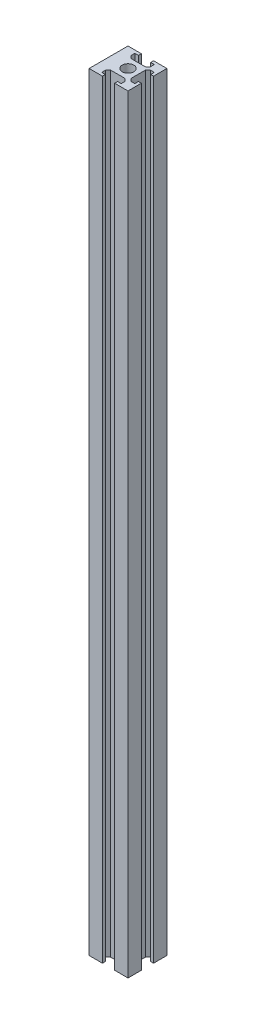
ISO-10303-21;
HEADER;
FILE_DESCRIPTION(('STEP AP214'),'2;1');
FILE_NAME('part.step','',(''),(''),'','','');
FILE_SCHEMA(('AUTOMOTIVE_DESIGN { 1 0 10303 214 1 1 1 1 }'));
ENDSEC;
DATA;
#1=APPLICATION_CONTEXT('core data for automotive mechanical design processes');
#2=APPLICATION_PROTOCOL_DEFINITION('international standard','automotive_design',2000,#1);
#3=PRODUCT_CONTEXT('',#1,'mechanical');
#4=PRODUCT('Part','Part','',(#3));
#5=PRODUCT_RELATED_PRODUCT_CATEGORY('part','',(#4));
#6=PRODUCT_DEFINITION_FORMATION('','',#4);
#7=PRODUCT_DEFINITION_CONTEXT('part definition',#1,'design');
#8=PRODUCT_DEFINITION('design','',#6,#7);
#9=PRODUCT_DEFINITION_SHAPE('','',#8);
#10=(LENGTH_UNIT() NAMED_UNIT(*) SI_UNIT(.MILLI.,.METRE.));
#11=(NAMED_UNIT(*) PLANE_ANGLE_UNIT() SI_UNIT($,.RADIAN.));
#12=(NAMED_UNIT(*) SI_UNIT($,.STERADIAN.) SOLID_ANGLE_UNIT());
#13=UNCERTAINTY_MEASURE_WITH_UNIT(LENGTH_MEASURE(1.E-05),#10,'distance_accuracy_value','');
#14=(GEOMETRIC_REPRESENTATION_CONTEXT(3) GLOBAL_UNCERTAINTY_ASSIGNED_CONTEXT((#13)) GLOBAL_UNIT_ASSIGNED_CONTEXT((#10,
#11,#12)) REPRESENTATION_CONTEXT('',''));
#15=CARTESIAN_POINT('',(0.,0.,0.));
#16=DIRECTION('',(0.,0.,1.));
#17=DIRECTION('',(1.,0.,0.));
#18=AXIS2_PLACEMENT_3D('',#15,#16,#17);
#19=CARTESIAN_POINT('',(0.,395.,0.));
#20=DIRECTION('',(0.,1.,0.));
#21=DIRECTION('',(0.,0.,1.));
#22=AXIS2_PLACEMENT_3D('',#19,#20,#21);
#23=PLANE('',#22);
#24=DIRECTION('',(0.,0.,1.));
#25=VECTOR('',#24,1.);
#26=CARTESIAN_POINT('',(-10.,395.,-10.));
#27=LINE('',#26,#25);
#28=CARTESIAN_POINT('',(-10.,395.,-10.));
#29=VERTEX_POINT('',#28);
#30=CARTESIAN_POINT('',(-10.,395.,10.));
#31=VERTEX_POINT('',#30);
#32=EDGE_CURVE('E353',#29,#31,#27,.T.);
#33=ORIENTED_EDGE('',*,*,#32,.T.);
#34=DIRECTION('',(1.,0.,0.));
#35=VECTOR('',#34,1.);
#36=CARTESIAN_POINT('',(-10.,395.,10.));
#37=LINE('',#36,#35);
#38=CARTESIAN_POINT('',(-3.125,395.,10.));
#39=VERTEX_POINT('',#38);
#40=EDGE_CURVE('E171',#31,#39,#37,.T.);
#41=ORIENTED_EDGE('',*,*,#40,.T.);
#42=DIRECTION('',(0.,0.,-1.));
#43=VECTOR('',#42,1.);
#44=CARTESIAN_POINT('',(-3.125,395.,10.));
#45=LINE('',#44,#43);
#46=CARTESIAN_POINT('',(-3.125,395.,8.5));
#47=VERTEX_POINT('',#46);
#48=EDGE_CURVE('E446',#39,#47,#45,.T.);
#49=ORIENTED_EDGE('',*,*,#48,.T.);
#50=DIRECTION('',(-1.,0.,0.));
#51=VECTOR('',#50,1.);
#52=CARTESIAN_POINT('',(-3.125,395.,8.5));
#53=LINE('',#52,#51);
#54=CARTESIAN_POINT('',(-5.,395.,8.5));
#55=VERTEX_POINT('',#54);
#56=EDGE_CURVE('E465',#47,#55,#53,.T.);
#57=ORIENTED_EDGE('',*,*,#56,.T.);
#58=DIRECTION('',(0.,0.,-1.));
#59=VECTOR('',#58,1.);
#60=CARTESIAN_POINT('',(-5.,395.,8.5));
#61=LINE('',#60,#59);
#62=CARTESIAN_POINT('',(-5.00000000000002,395.,6.50482755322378));
#63=VERTEX_POINT('',#62);
#64=EDGE_CURVE('E462',#55,#63,#61,.T.);
#65=ORIENTED_EDGE('',*,*,#64,.T.);
#66=DIRECTION('',(0.703833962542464,0.,-0.71036452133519));
#67=VECTOR('',#66,1.);
#68=CARTESIAN_POINT('',(-5.00000000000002,395.,6.50482755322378));
#69=LINE('',#68,#67);
#70=CARTESIAN_POINT('',(-3.7071680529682,395.,5.19999999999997));
#71=VERTEX_POINT('',#70);
#72=EDGE_CURVE('E464',#63,#71,#69,.T.);
#73=ORIENTED_EDGE('',*,*,#72,.T.);
#74=DIRECTION('',(1.,0.,0.));
#75=VECTOR('',#74,1.);
#76=CARTESIAN_POINT('',(3.7071680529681,395.,5.20000000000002));
#77=LINE('',#76,#75);
#78=CARTESIAN_POINT('',(3.7071680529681,395.,5.20000000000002));
#79=VERTEX_POINT('',#78);
#80=EDGE_CURVE('E467',#71,#79,#77,.T.);
#81=ORIENTED_EDGE('',*,*,#80,.T.);
#82=DIRECTION('',(0.703833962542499,0.,0.710364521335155));
#83=VECTOR('',#82,1.);
#84=CARTESIAN_POINT('',(5.,395.,6.50482755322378));
#85=LINE('',#84,#83);
#86=CARTESIAN_POINT('',(5.,395.,6.50482755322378));
#87=VERTEX_POINT('',#86);
#88=EDGE_CURVE('E473',#79,#87,#85,.T.);
#89=ORIENTED_EDGE('',*,*,#88,.T.);
#90=DIRECTION('',(0.,0.,1.));
#91=VECTOR('',#90,1.);
#92=CARTESIAN_POINT('',(5.,395.,8.5));
#93=LINE('',#92,#91);
#94=CARTESIAN_POINT('',(5.,395.,8.5));
#95=VERTEX_POINT('',#94);
#96=EDGE_CURVE('E475',#87,#95,#93,.T.);
#97=ORIENTED_EDGE('',*,*,#96,.T.);
#98=DIRECTION('',(-1.,0.,0.));
#99=VECTOR('',#98,1.);
#100=CARTESIAN_POINT('',(3.125,395.,8.5));
#101=LINE('',#100,#99);
#102=CARTESIAN_POINT('',(3.125,395.,8.5));
#103=VERTEX_POINT('',#102);
#104=EDGE_CURVE('E477',#95,#103,#101,.T.);
#105=ORIENTED_EDGE('',*,*,#104,.T.);
#106=DIRECTION('',(0.,0.,1.));
#107=VECTOR('',#106,1.);
#108=CARTESIAN_POINT('',(3.125,395.,10.));
#109=LINE('',#108,#107);
#110=CARTESIAN_POINT('',(3.125,395.,10.));
#111=VERTEX_POINT('',#110);
#112=EDGE_CURVE('E479',#103,#111,#109,.T.);
#113=ORIENTED_EDGE('',*,*,#112,.T.);
#114=DIRECTION('',(1.,0.,0.));
#115=VECTOR('',#114,1.);
#116=CARTESIAN_POINT('',(3.125,395.,10.));
#117=LINE('',#116,#115);
#118=CARTESIAN_POINT('',(10.,395.,10.));
#119=VERTEX_POINT('',#118);
#120=EDGE_CURVE('E481',#111,#119,#117,.T.);
#121=ORIENTED_EDGE('',*,*,#120,.T.);
#122=DIRECTION('',(0.,0.,-1.));
#123=VECTOR('',#122,1.);
#124=CARTESIAN_POINT('',(9.99999999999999,395.,3.12500000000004));
#125=LINE('',#124,#123);
#126=CARTESIAN_POINT('',(9.99999999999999,395.,3.12500000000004));
#127=VERTEX_POINT('',#126);
#128=EDGE_CURVE('E483',#119,#127,#125,.T.);
#129=ORIENTED_EDGE('',*,*,#128,.T.);
#130=DIRECTION('',(-1.,0.,0.));
#131=VECTOR('',#130,1.);
#132=CARTESIAN_POINT('',(9.99999999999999,395.,3.12500000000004));
#133=LINE('',#132,#131);
#134=CARTESIAN_POINT('',(8.49999999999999,395.,3.12500000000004));
#135=VERTEX_POINT('',#134);
#136=EDGE_CURVE('E485',#127,#135,#133,.T.);
#137=ORIENTED_EDGE('',*,*,#136,.T.);
#138=DIRECTION('',(0.,0.,1.));
#139=VECTOR('',#138,1.);
#140=CARTESIAN_POINT('',(8.49999999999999,395.,3.12500000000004));
#141=LINE('',#140,#139);
#142=CARTESIAN_POINT('',(8.49999999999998,395.,5.00000000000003));
#143=VERTEX_POINT('',#142);
#144=EDGE_CURVE('E487',#135,#143,#141,.T.);
#145=ORIENTED_EDGE('',*,*,#144,.T.);
#146=DIRECTION('',(-1.,0.,0.));
#147=VECTOR('',#146,1.);
#148=CARTESIAN_POINT('',(8.49999999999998,395.,5.00000000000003));
#149=LINE('',#148,#147);
#150=CARTESIAN_POINT('',(6.50482755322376,395.,5.00000000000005));
#151=VERTEX_POINT('',#150);
#152=EDGE_CURVE('E489',#143,#151,#149,.T.);
#153=ORIENTED_EDGE('',*,*,#152,.T.);
#154=DIRECTION('',(-0.71036452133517,0.,-0.703833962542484));
#155=VECTOR('',#154,1.);
#156=CARTESIAN_POINT('',(6.50482755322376,395.,5.00000000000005));
#157=LINE('',#156,#155);
#158=CARTESIAN_POINT('',(5.19999999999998,395.,3.70716805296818));
#159=VERTEX_POINT('',#158);
#160=EDGE_CURVE('E491',#151,#159,#157,.T.);
#161=ORIENTED_EDGE('',*,*,#160,.T.);
#162=DIRECTION('',(0.,0.,-1.));
#163=VECTOR('',#162,1.);
#164=CARTESIAN_POINT('',(5.20000000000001,395.,-3.70716805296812));
#165=LINE('',#164,#163);
#166=CARTESIAN_POINT('',(5.20000000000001,395.,-3.70716805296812));
#167=VERTEX_POINT('',#166);
#168=EDGE_CURVE('E493',#159,#167,#165,.T.);
#169=ORIENTED_EDGE('',*,*,#168,.T.);
#170=DIRECTION('',(0.710364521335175,0.,-0.703833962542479));
#171=VECTOR('',#170,1.);
#172=CARTESIAN_POINT('',(6.5048275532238,395.,-4.99999999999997));
#173=LINE('',#172,#171);
#174=CARTESIAN_POINT('',(6.5048275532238,395.,-4.99999999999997));
#175=VERTEX_POINT('',#174);
#176=EDGE_CURVE('E495',#167,#175,#173,.T.);
#177=ORIENTED_EDGE('',*,*,#176,.T.);
#178=DIRECTION('',(1.,0.,0.));
#179=VECTOR('',#178,1.);
#180=CARTESIAN_POINT('',(8.50000000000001,395.,-4.99999999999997));
#181=LINE('',#180,#179);
#182=CARTESIAN_POINT('',(8.50000000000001,395.,-4.99999999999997));
#183=VERTEX_POINT('',#182);
#184=EDGE_CURVE('E497',#175,#183,#181,.T.);
#185=ORIENTED_EDGE('',*,*,#184,.T.);
#186=DIRECTION('',(0.,0.,1.));
#187=VECTOR('',#186,1.);
#188=CARTESIAN_POINT('',(8.50000000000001,395.,-3.12499999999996));
#189=LINE('',#188,#187);
#190=CARTESIAN_POINT('',(8.50000000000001,395.,-3.12499999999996));
#191=VERTEX_POINT('',#190);
#192=EDGE_CURVE('E499',#183,#191,#189,.T.);
#193=ORIENTED_EDGE('',*,*,#192,.T.);
#194=DIRECTION('',(1.,0.,0.));
#195=VECTOR('',#194,1.);
#196=CARTESIAN_POINT('',(10.,395.,-3.12499999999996));
#197=LINE('',#196,#195);
#198=CARTESIAN_POINT('',(10.,395.,-3.12499999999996));
#199=VERTEX_POINT('',#198);
#200=EDGE_CURVE('E501',#191,#199,#197,.T.);
#201=ORIENTED_EDGE('',*,*,#200,.T.);
#202=DIRECTION('',(0.,0.,-1.));
#203=VECTOR('',#202,1.);
#204=CARTESIAN_POINT('',(10.,395.,-10.));
#205=LINE('',#204,#203);
#206=CARTESIAN_POINT('',(10.,395.,-10.));
#207=VERTEX_POINT('',#206);
#208=EDGE_CURVE('E503',#199,#207,#205,.T.);
#209=ORIENTED_EDGE('',*,*,#208,.T.);
#210=DIRECTION('',(-1.,0.,0.));
#211=VECTOR('',#210,1.);
#212=CARTESIAN_POINT('',(3.125,395.,-10.));
#213=LINE('',#212,#211);
#214=CARTESIAN_POINT('',(3.125,395.,-10.));
#215=VERTEX_POINT('',#214);
#216=EDGE_CURVE('E505',#207,#215,#213,.T.);
#217=ORIENTED_EDGE('',*,*,#216,.T.);
#218=DIRECTION('',(0.,0.,1.));
#219=VECTOR('',#218,1.);
#220=CARTESIAN_POINT('',(3.125,395.,-10.));
#221=LINE('',#220,#219);
#222=CARTESIAN_POINT('',(3.12500000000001,395.,-8.5));
#223=VERTEX_POINT('',#222);
#224=EDGE_CURVE('E507',#215,#223,#221,.T.);
#225=ORIENTED_EDGE('',*,*,#224,.T.);
#226=DIRECTION('',(1.,0.,0.));
#227=VECTOR('',#226,1.);
#228=CARTESIAN_POINT('',(3.12500000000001,395.,-8.5));
#229=LINE('',#228,#227);
#230=CARTESIAN_POINT('',(5.00000000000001,395.,-8.5));
#231=VERTEX_POINT('',#230);
#232=EDGE_CURVE('E509',#223,#231,#229,.T.);
#233=ORIENTED_EDGE('',*,*,#232,.T.);
#234=DIRECTION('',(0.,0.,1.));
#235=VECTOR('',#234,1.);
#236=CARTESIAN_POINT('',(5.00000000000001,395.,-8.5));
#237=LINE('',#236,#235);
#238=CARTESIAN_POINT('',(5.00000000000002,395.,-6.50482755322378));
#239=VERTEX_POINT('',#238);
#240=EDGE_CURVE('E511',#231,#239,#237,.T.);
#241=ORIENTED_EDGE('',*,*,#240,.T.);
#242=DIRECTION('',(-0.703833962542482,0.,0.710364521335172));
#243=VECTOR('',#242,1.);
#244=CARTESIAN_POINT('',(5.00000000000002,395.,-6.50482755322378));
#245=LINE('',#244,#243);
#246=CARTESIAN_POINT('',(3.70716805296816,395.,-5.2));
#247=VERTEX_POINT('',#246);
#248=EDGE_CURVE('E513',#239,#247,#245,.T.);
#249=ORIENTED_EDGE('',*,*,#248,.T.);
#250=DIRECTION('',(-1.,0.,0.));
#251=VECTOR('',#250,1.);
#252=CARTESIAN_POINT('',(-3.70716805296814,395.,-5.2));
#253=LINE('',#252,#251);
#254=CARTESIAN_POINT('',(-3.70716805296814,395.,-5.2));
#255=VERTEX_POINT('',#254);
#256=EDGE_CURVE('E515',#247,#255,#253,.T.);
#257=ORIENTED_EDGE('',*,*,#256,.T.);
#258=DIRECTION('',(-0.703833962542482,0.,-0.710364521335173));
#259=VECTOR('',#258,1.);
#260=CARTESIAN_POINT('',(-4.99999999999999,395.,-6.50482755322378));
#261=LINE('',#260,#259);
#262=CARTESIAN_POINT('',(-4.99999999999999,395.,-6.50482755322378));
#263=VERTEX_POINT('',#262);
#264=EDGE_CURVE('E517',#255,#263,#261,.T.);
#265=ORIENTED_EDGE('',*,*,#264,.T.);
#266=DIRECTION('',(0.,0.,-1.));
#267=VECTOR('',#266,1.);
#268=CARTESIAN_POINT('',(-4.99999999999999,395.,-8.5));
#269=LINE('',#268,#267);
#270=CARTESIAN_POINT('',(-4.99999999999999,395.,-8.5));
#271=VERTEX_POINT('',#270);
#272=EDGE_CURVE('E268',#263,#271,#269,.T.);
#273=ORIENTED_EDGE('',*,*,#272,.T.);
#274=DIRECTION('',(1.,0.,0.));
#275=VECTOR('',#274,1.);
#276=CARTESIAN_POINT('',(-3.12499999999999,395.,-8.5));
#277=LINE('',#276,#275);
#278=CARTESIAN_POINT('',(-3.12499999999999,395.,-8.5));
#279=VERTEX_POINT('',#278);
#280=EDGE_CURVE('E262',#271,#279,#277,.T.);
#281=ORIENTED_EDGE('',*,*,#280,.T.);
#282=DIRECTION('',(0.,0.,-1.));
#283=VECTOR('',#282,1.);
#284=CARTESIAN_POINT('',(-3.12499999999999,395.,-10.));
#285=LINE('',#284,#283);
#286=CARTESIAN_POINT('',(-3.12499999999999,395.,-10.));
#287=VERTEX_POINT('',#286);
#288=EDGE_CURVE('E266',#279,#287,#285,.T.);
#289=ORIENTED_EDGE('',*,*,#288,.T.);
#290=DIRECTION('',(-1.,0.,0.));
#291=VECTOR('',#290,1.);
#292=CARTESIAN_POINT('',(-10.,395.,-10.));
#293=LINE('',#292,#291);
#294=EDGE_CURVE('E50',#287,#29,#293,.T.);
#295=ORIENTED_EDGE('',*,*,#294,.T.);
#296=EDGE_LOOP('',(#33,#41,#49,#57,#65,#73,#81,#89,#97,#105,#113,#121,#129,#137,#145,#153,#161,
#169,#177,#185,#193,#201,#209,#217,#225,#233,#241,#249,#257,#265,#273,#281,#289,#295));
#297=FACE_BOUND('',#296,.T.);
#298=CARTESIAN_POINT('',(0.,395.,0.));
#299=DIRECTION('',(0.,1.,0.));
#300=DIRECTION('',(0.,0.,1.));
#301=AXIS2_PLACEMENT_3D('',#298,#299,#300);
#302=CIRCLE('',#301,3.);
#303=CARTESIAN_POINT('',(0.,395.,-3.00000000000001));
#304=VERTEX_POINT('',#303);
#305=EDGE_CURVE('E290',#304,#304,#302,.T.);
#306=ORIENTED_EDGE('',*,*,#305,.F.);
#307=EDGE_LOOP('',(#306));
#308=FACE_BOUND('',#307,.T.);
#309=ADVANCED_FACE('F33',(#297,#308),#23,.T.);
#310=CARTESIAN_POINT('',(0.,0.,0.));
#311=DIRECTION('',(0.,1.,0.));
#312=DIRECTION('',(0.,0.,1.));
#313=AXIS2_PLACEMENT_3D('',#310,#311,#312);
#314=PLANE('',#313);
#315=DIRECTION('',(0.,0.,1.));
#316=VECTOR('',#315,1.);
#317=CARTESIAN_POINT('',(-10.,0.,-10.));
#318=LINE('',#317,#316);
#319=CARTESIAN_POINT('',(-10.,0.,-10.));
#320=VERTEX_POINT('',#319);
#321=CARTESIAN_POINT('',(-10.,0.,10.));
#322=VERTEX_POINT('',#321);
#323=EDGE_CURVE('E286',#320,#322,#318,.T.);
#324=ORIENTED_EDGE('',*,*,#323,.F.);
#325=DIRECTION('',(-1.,0.,0.));
#326=VECTOR('',#325,1.);
#327=CARTESIAN_POINT('',(-10.,0.,-10.));
#328=LINE('',#327,#326);
#329=CARTESIAN_POINT('',(-3.12499999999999,0.,-10.));
#330=VERTEX_POINT('',#329);
#331=EDGE_CURVE('E163',#330,#320,#328,.T.);
#332=ORIENTED_EDGE('',*,*,#331,.F.);
#333=DIRECTION('',(0.,0.,-1.));
#334=VECTOR('',#333,1.);
#335=CARTESIAN_POINT('',(-3.12499999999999,0.,-10.));
#336=LINE('',#335,#334);
#337=CARTESIAN_POINT('',(-3.12499999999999,0.,-8.5));
#338=VERTEX_POINT('',#337);
#339=EDGE_CURVE('E157',#338,#330,#336,.T.);
#340=ORIENTED_EDGE('',*,*,#339,.F.);
#341=DIRECTION('',(1.,0.,0.));
#342=VECTOR('',#341,1.);
#343=CARTESIAN_POINT('',(-3.12499999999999,0.,-8.5));
#344=LINE('',#343,#342);
#345=CARTESIAN_POINT('',(-4.99999999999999,0.,-8.5));
#346=VERTEX_POINT('',#345);
#347=EDGE_CURVE('E276',#346,#338,#344,.T.);
#348=ORIENTED_EDGE('',*,*,#347,.F.);
#349=DIRECTION('',(0.,0.,-1.));
#350=VECTOR('',#349,1.);
#351=CARTESIAN_POINT('',(-4.99999999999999,0.,-8.5));
#352=LINE('',#351,#350);
#353=CARTESIAN_POINT('',(-4.99999999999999,0.,-6.50482755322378));
#354=VERTEX_POINT('',#353);
#355=EDGE_CURVE('E348',#354,#346,#352,.T.);
#356=ORIENTED_EDGE('',*,*,#355,.F.);
#357=DIRECTION('',(-0.703833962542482,0.,-0.710364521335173));
#358=VECTOR('',#357,1.);
#359=CARTESIAN_POINT('',(-4.99999999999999,0.,-6.50482755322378));
#360=LINE('',#359,#358);
#361=CARTESIAN_POINT('',(-3.70716805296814,0.,-5.2));
#362=VERTEX_POINT('',#361);
#363=EDGE_CURVE('E346',#362,#354,#360,.T.);
#364=ORIENTED_EDGE('',*,*,#363,.F.);
#365=DIRECTION('',(-1.,0.,0.));
#366=VECTOR('',#365,1.);
#367=CARTESIAN_POINT('',(-3.70716805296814,0.,-5.2));
#368=LINE('',#367,#366);
#369=CARTESIAN_POINT('',(3.70716805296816,0.,-5.2));
#370=VERTEX_POINT('',#369);
#371=EDGE_CURVE('E344',#370,#362,#368,.T.);
#372=ORIENTED_EDGE('',*,*,#371,.F.);
#373=DIRECTION('',(-0.703833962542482,0.,0.710364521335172));
#374=VECTOR('',#373,1.);
#375=CARTESIAN_POINT('',(5.00000000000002,0.,-6.50482755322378));
#376=LINE('',#375,#374);
#377=CARTESIAN_POINT('',(5.00000000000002,0.,-6.50482755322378));
#378=VERTEX_POINT('',#377);
#379=EDGE_CURVE('E342',#378,#370,#376,.T.);
#380=ORIENTED_EDGE('',*,*,#379,.F.);
#381=DIRECTION('',(0.,0.,1.));
#382=VECTOR('',#381,1.);
#383=CARTESIAN_POINT('',(5.00000000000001,0.,-8.5));
#384=LINE('',#383,#382);
#385=CARTESIAN_POINT('',(5.00000000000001,0.,-8.5));
#386=VERTEX_POINT('',#385);
#387=EDGE_CURVE('E340',#386,#378,#384,.T.);
#388=ORIENTED_EDGE('',*,*,#387,.F.);
#389=DIRECTION('',(1.,0.,0.));
#390=VECTOR('',#389,1.);
#391=CARTESIAN_POINT('',(3.12500000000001,0.,-8.5));
#392=LINE('',#391,#390);
#393=CARTESIAN_POINT('',(3.12500000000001,0.,-8.5));
#394=VERTEX_POINT('',#393);
#395=EDGE_CURVE('E338',#394,#386,#392,.T.);
#396=ORIENTED_EDGE('',*,*,#395,.F.);
#397=DIRECTION('',(0.,0.,1.));
#398=VECTOR('',#397,1.);
#399=CARTESIAN_POINT('',(3.125,0.,-10.));
#400=LINE('',#399,#398);
#401=CARTESIAN_POINT('',(3.125,0.,-10.));
#402=VERTEX_POINT('',#401);
#403=EDGE_CURVE('E336',#402,#394,#400,.T.);
#404=ORIENTED_EDGE('',*,*,#403,.F.);
#405=DIRECTION('',(-1.,0.,0.));
#406=VECTOR('',#405,1.);
#407=CARTESIAN_POINT('',(3.125,0.,-10.));
#408=LINE('',#407,#406);
#409=CARTESIAN_POINT('',(10.,0.,-10.));
#410=VERTEX_POINT('',#409);
#411=EDGE_CURVE('E334',#410,#402,#408,.T.);
#412=ORIENTED_EDGE('',*,*,#411,.F.);
#413=DIRECTION('',(0.,0.,-1.));
#414=VECTOR('',#413,1.);
#415=CARTESIAN_POINT('',(10.,0.,-10.));
#416=LINE('',#415,#414);
#417=CARTESIAN_POINT('',(10.,0.,-3.12499999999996));
#418=VERTEX_POINT('',#417);
#419=EDGE_CURVE('E332',#418,#410,#416,.T.);
#420=ORIENTED_EDGE('',*,*,#419,.F.);
#421=DIRECTION('',(1.,0.,0.));
#422=VECTOR('',#421,1.);
#423=CARTESIAN_POINT('',(10.,0.,-3.12499999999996));
#424=LINE('',#423,#422);
#425=CARTESIAN_POINT('',(8.50000000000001,0.,-3.12499999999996));
#426=VERTEX_POINT('',#425);
#427=EDGE_CURVE('E330',#426,#418,#424,.T.);
#428=ORIENTED_EDGE('',*,*,#427,.F.);
#429=DIRECTION('',(0.,0.,1.));
#430=VECTOR('',#429,1.);
#431=CARTESIAN_POINT('',(8.50000000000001,0.,-3.12499999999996));
#432=LINE('',#431,#430);
#433=CARTESIAN_POINT('',(8.50000000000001,0.,-4.99999999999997));
#434=VERTEX_POINT('',#433);
#435=EDGE_CURVE('E328',#434,#426,#432,.T.);
#436=ORIENTED_EDGE('',*,*,#435,.F.);
#437=DIRECTION('',(1.,0.,0.));
#438=VECTOR('',#437,1.);
#439=CARTESIAN_POINT('',(8.50000000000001,0.,-4.99999999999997));
#440=LINE('',#439,#438);
#441=CARTESIAN_POINT('',(6.5048275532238,0.,-4.99999999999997));
#442=VERTEX_POINT('',#441);
#443=EDGE_CURVE('E326',#442,#434,#440,.T.);
#444=ORIENTED_EDGE('',*,*,#443,.F.);
#445=DIRECTION('',(0.710364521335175,0.,-0.703833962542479));
#446=VECTOR('',#445,1.);
#447=CARTESIAN_POINT('',(6.5048275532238,0.,-4.99999999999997));
#448=LINE('',#447,#446);
#449=CARTESIAN_POINT('',(5.20000000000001,0.,-3.70716805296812));
#450=VERTEX_POINT('',#449);
#451=EDGE_CURVE('E324',#450,#442,#448,.T.);
#452=ORIENTED_EDGE('',*,*,#451,.F.);
#453=DIRECTION('',(0.,0.,-1.));
#454=VECTOR('',#453,1.);
#455=CARTESIAN_POINT('',(5.20000000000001,0.,-3.70716805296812));
#456=LINE('',#455,#454);
#457=CARTESIAN_POINT('',(5.19999999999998,0.,3.70716805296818));
#458=VERTEX_POINT('',#457);
#459=EDGE_CURVE('E322',#458,#450,#456,.T.);
#460=ORIENTED_EDGE('',*,*,#459,.F.);
#461=DIRECTION('',(-0.71036452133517,0.,-0.703833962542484));
#462=VECTOR('',#461,1.);
#463=CARTESIAN_POINT('',(6.50482755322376,0.,5.00000000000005));
#464=LINE('',#463,#462);
#465=CARTESIAN_POINT('',(6.50482755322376,0.,5.00000000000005));
#466=VERTEX_POINT('',#465);
#467=EDGE_CURVE('E320',#466,#458,#464,.T.);
#468=ORIENTED_EDGE('',*,*,#467,.F.);
#469=DIRECTION('',(-1.,0.,0.));
#470=VECTOR('',#469,1.);
#471=CARTESIAN_POINT('',(8.49999999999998,0.,5.00000000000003));
#472=LINE('',#471,#470);
#473=CARTESIAN_POINT('',(8.49999999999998,0.,5.00000000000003));
#474=VERTEX_POINT('',#473);
#475=EDGE_CURVE('E318',#474,#466,#472,.T.);
#476=ORIENTED_EDGE('',*,*,#475,.F.);
#477=DIRECTION('',(0.,0.,1.));
#478=VECTOR('',#477,1.);
#479=CARTESIAN_POINT('',(8.49999999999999,0.,3.12500000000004));
#480=LINE('',#479,#478);
#481=CARTESIAN_POINT('',(8.49999999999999,0.,3.12500000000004));
#482=VERTEX_POINT('',#481);
#483=EDGE_CURVE('E316',#482,#474,#480,.T.);
#484=ORIENTED_EDGE('',*,*,#483,.F.);
#485=DIRECTION('',(-1.,0.,0.));
#486=VECTOR('',#485,1.);
#487=CARTESIAN_POINT('',(9.99999999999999,0.,3.12500000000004));
#488=LINE('',#487,#486);
#489=CARTESIAN_POINT('',(9.99999999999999,0.,3.12500000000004));
#490=VERTEX_POINT('',#489);
#491=EDGE_CURVE('E314',#490,#482,#488,.T.);
#492=ORIENTED_EDGE('',*,*,#491,.F.);
#493=DIRECTION('',(0.,0.,-1.));
#494=VECTOR('',#493,1.);
#495=CARTESIAN_POINT('',(9.99999999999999,0.,3.12500000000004));
#496=LINE('',#495,#494);
#497=CARTESIAN_POINT('',(10.,0.,10.));
#498=VERTEX_POINT('',#497);
#499=EDGE_CURVE('E312',#498,#490,#496,.T.);
#500=ORIENTED_EDGE('',*,*,#499,.F.);
#501=DIRECTION('',(1.,0.,0.));
#502=VECTOR('',#501,1.);
#503=CARTESIAN_POINT('',(3.125,0.,10.));
#504=LINE('',#503,#502);
#505=CARTESIAN_POINT('',(3.125,0.,10.));
#506=VERTEX_POINT('',#505);
#507=EDGE_CURVE('E310',#506,#498,#504,.T.);
#508=ORIENTED_EDGE('',*,*,#507,.F.);
#509=DIRECTION('',(0.,0.,1.));
#510=VECTOR('',#509,1.);
#511=CARTESIAN_POINT('',(3.125,0.,10.));
#512=LINE('',#511,#510);
#513=CARTESIAN_POINT('',(3.125,0.,8.5));
#514=VERTEX_POINT('',#513);
#515=EDGE_CURVE('E308',#514,#506,#512,.T.);
#516=ORIENTED_EDGE('',*,*,#515,.F.);
#517=DIRECTION('',(-1.,0.,0.));
#518=VECTOR('',#517,1.);
#519=CARTESIAN_POINT('',(3.125,0.,8.5));
#520=LINE('',#519,#518);
#521=CARTESIAN_POINT('',(5.,0.,8.5));
#522=VERTEX_POINT('',#521);
#523=EDGE_CURVE('E306',#522,#514,#520,.T.);
#524=ORIENTED_EDGE('',*,*,#523,.F.);
#525=DIRECTION('',(0.,0.,1.));
#526=VECTOR('',#525,1.);
#527=CARTESIAN_POINT('',(5.,0.,8.5));
#528=LINE('',#527,#526);
#529=CARTESIAN_POINT('',(5.,0.,6.50482755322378));
#530=VERTEX_POINT('',#529);
#531=EDGE_CURVE('E304',#530,#522,#528,.T.);
#532=ORIENTED_EDGE('',*,*,#531,.F.);
#533=DIRECTION('',(0.703833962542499,0.,0.710364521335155));
#534=VECTOR('',#533,1.);
#535=CARTESIAN_POINT('',(5.,0.,6.50482755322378));
#536=LINE('',#535,#534);
#537=CARTESIAN_POINT('',(3.7071680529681,0.,5.20000000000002));
#538=VERTEX_POINT('',#537);
#539=EDGE_CURVE('E302',#538,#530,#536,.T.);
#540=ORIENTED_EDGE('',*,*,#539,.F.);
#541=DIRECTION('',(1.,0.,0.));
#542=VECTOR('',#541,1.);
#543=CARTESIAN_POINT('',(3.7071680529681,0.,5.20000000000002));
#544=LINE('',#543,#542);
#545=CARTESIAN_POINT('',(-3.7071680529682,0.,5.19999999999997));
#546=VERTEX_POINT('',#545);
#547=EDGE_CURVE('E300',#546,#538,#544,.T.);
#548=ORIENTED_EDGE('',*,*,#547,.F.);
#549=DIRECTION('',(0.703833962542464,0.,-0.71036452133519));
#550=VECTOR('',#549,1.);
#551=CARTESIAN_POINT('',(-5.00000000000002,0.,6.50482755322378));
#552=LINE('',#551,#550);
#553=CARTESIAN_POINT('',(-5.00000000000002,0.,6.50482755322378));
#554=VERTEX_POINT('',#553);
#555=EDGE_CURVE('E298',#554,#546,#552,.T.);
#556=ORIENTED_EDGE('',*,*,#555,.F.);
#557=DIRECTION('',(0.,0.,-1.));
#558=VECTOR('',#557,1.);
#559=CARTESIAN_POINT('',(-5.,0.,8.5));
#560=LINE('',#559,#558);
#561=CARTESIAN_POINT('',(-5.,0.,8.5));
#562=VERTEX_POINT('',#561);
#563=EDGE_CURVE('E296',#562,#554,#560,.T.);
#564=ORIENTED_EDGE('',*,*,#563,.F.);
#565=DIRECTION('',(-1.,0.,0.));
#566=VECTOR('',#565,1.);
#567=CARTESIAN_POINT('',(-3.125,0.,8.5));
#568=LINE('',#567,#566);
#569=CARTESIAN_POINT('',(-3.125,0.,8.5));
#570=VERTEX_POINT('',#569);
#571=EDGE_CURVE('E294',#570,#562,#568,.T.);
#572=ORIENTED_EDGE('',*,*,#571,.F.);
#573=DIRECTION('',(0.,0.,-1.));
#574=VECTOR('',#573,1.);
#575=CARTESIAN_POINT('',(-3.125,0.,10.));
#576=LINE('',#575,#574);
#577=CARTESIAN_POINT('',(-3.125,0.,10.));
#578=VERTEX_POINT('',#577);
#579=EDGE_CURVE('E292',#578,#570,#576,.T.);
#580=ORIENTED_EDGE('',*,*,#579,.F.);
#581=DIRECTION('',(1.,0.,0.));
#582=VECTOR('',#581,1.);
#583=CARTESIAN_POINT('',(-10.,0.,10.));
#584=LINE('',#583,#582);
#585=EDGE_CURVE('E289',#322,#578,#584,.T.);
#586=ORIENTED_EDGE('',*,*,#585,.F.);
#587=EDGE_LOOP('',(#324,#332,#340,#348,#356,#364,#372,#380,#388,#396,#404,#412,#420,#428,#436,
#444,#452,#460,#468,#476,#484,#492,#500,#508,#516,#524,#532,#540,#548,#556,#564,#572,#580,#586));
#588=FACE_BOUND('',#587,.T.);
#589=CARTESIAN_POINT('',(0.,0.,0.));
#590=DIRECTION('',(0.,1.,0.));
#591=DIRECTION('',(0.,0.,1.));
#592=AXIS2_PLACEMENT_3D('',#589,#590,#591);
#593=CIRCLE('',#592,3.);
#594=CARTESIAN_POINT('',(0.,0.,-3.00000000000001));
#595=VERTEX_POINT('',#594);
#596=EDGE_CURVE('E950',#595,#595,#593,.T.);
#597=ORIENTED_EDGE('',*,*,#596,.T.);
#598=EDGE_LOOP('',(#597));
#599=FACE_BOUND('',#598,.T.);
#600=ADVANCED_FACE('F450',(#588,#599),#314,.F.);
#601=CARTESIAN_POINT('',(-10.,395.,-10.));
#602=DIRECTION('',(1.,0.,0.));
#603=DIRECTION('',(0.,0.,-1.));
#604=AXIS2_PLACEMENT_3D('',#601,#602,#603);
#605=PLANE('',#604);
#606=ORIENTED_EDGE('',*,*,#323,.T.);
#607=DIRECTION('',(0.,-1.,0.));
#608=VECTOR('',#607,1.);
#609=CARTESIAN_POINT('',(-10.,395.,10.));
#610=LINE('',#609,#608);
#611=EDGE_CURVE('E11',#31,#322,#610,.T.);
#612=ORIENTED_EDGE('',*,*,#611,.F.);
#613=ORIENTED_EDGE('',*,*,#32,.F.);
#614=DIRECTION('',(0.,-1.,0.));
#615=VECTOR('',#614,1.);
#616=CARTESIAN_POINT('',(-10.,395.,-10.));
#617=LINE('',#616,#615);
#618=EDGE_CURVE('E282',#29,#320,#617,.T.);
#619=ORIENTED_EDGE('',*,*,#618,.T.);
#620=EDGE_LOOP('',(#606,#612,#613,#619));
#621=FACE_BOUND('',#620,.T.);
#622=ADVANCED_FACE('F35',(#621),#605,.F.);
#623=CARTESIAN_POINT('',(-10.,395.,10.));
#624=DIRECTION('',(0.,0.,-1.));
#625=DIRECTION('',(-1.,0.,0.));
#626=AXIS2_PLACEMENT_3D('',#623,#624,#625);
#627=PLANE('',#626);
#628=ORIENTED_EDGE('',*,*,#585,.T.);
#629=DIRECTION('',(0.,-1.,0.));
#630=VECTOR('',#629,1.);
#631=CARTESIAN_POINT('',(-3.125,395.,10.));
#632=LINE('',#631,#630);
#633=EDGE_CURVE('E42',#39,#578,#632,.T.);
#634=ORIENTED_EDGE('',*,*,#633,.F.);
#635=ORIENTED_EDGE('',*,*,#40,.F.);
#636=ORIENTED_EDGE('',*,*,#611,.T.);
#637=EDGE_LOOP('',(#628,#634,#635,#636));
#638=FACE_BOUND('',#637,.T.);
#639=ADVANCED_FACE('F551',(#638),#627,.F.);
#640=CARTESIAN_POINT('',(-3.125,395.,10.));
#641=DIRECTION('',(-1.,0.,0.));
#642=DIRECTION('',(0.,0.,1.));
#643=AXIS2_PLACEMENT_3D('',#640,#641,#642);
#644=PLANE('',#643);
#645=ORIENTED_EDGE('',*,*,#579,.T.);
#646=DIRECTION('',(0.,-1.,0.));
#647=VECTOR('',#646,1.);
#648=CARTESIAN_POINT('',(-3.125,395.,8.5));
#649=LINE('',#648,#647);
#650=EDGE_CURVE('E438',#47,#570,#649,.T.);
#651=ORIENTED_EDGE('',*,*,#650,.F.);
#652=ORIENTED_EDGE('',*,*,#48,.F.);
#653=ORIENTED_EDGE('',*,*,#633,.T.);
#654=EDGE_LOOP('',(#645,#651,#652,#653));
#655=FACE_BOUND('',#654,.T.);
#656=ADVANCED_FACE('F444',(#655),#644,.F.);
#657=CARTESIAN_POINT('',(-3.125,395.,8.5));
#658=DIRECTION('',(0.,0.,1.));
#659=DIRECTION('',(1.,0.,0.));
#660=AXIS2_PLACEMENT_3D('',#657,#658,#659);
#661=PLANE('',#660);
#662=ORIENTED_EDGE('',*,*,#571,.T.);
#663=DIRECTION('',(0.,-1.,0.));
#664=VECTOR('',#663,1.);
#665=CARTESIAN_POINT('',(-5.,395.,8.5));
#666=LINE('',#665,#664);
#667=EDGE_CURVE('E435',#55,#562,#666,.T.);
#668=ORIENTED_EDGE('',*,*,#667,.F.);
#669=ORIENTED_EDGE('',*,*,#56,.F.);
#670=ORIENTED_EDGE('',*,*,#650,.T.);
#671=EDGE_LOOP('',(#662,#668,#669,#670));
#672=FACE_BOUND('',#671,.T.);
#673=ADVANCED_FACE('F456',(#672),#661,.F.);
#674=CARTESIAN_POINT('',(-5.,395.,8.5));
#675=DIRECTION('',(-1.,0.,0.));
#676=DIRECTION('',(0.,0.,1.));
#677=AXIS2_PLACEMENT_3D('',#674,#675,#676);
#678=PLANE('',#677);
#679=ORIENTED_EDGE('',*,*,#563,.T.);
#680=DIRECTION('',(0.,-1.,0.));
#681=VECTOR('',#680,1.);
#682=CARTESIAN_POINT('',(-5.00000000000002,395.,6.50482755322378));
#683=LINE('',#682,#681);
#684=EDGE_CURVE('E432',#63,#554,#683,.T.);
#685=ORIENTED_EDGE('',*,*,#684,.F.);
#686=ORIENTED_EDGE('',*,*,#64,.F.);
#687=ORIENTED_EDGE('',*,*,#667,.T.);
#688=EDGE_LOOP('',(#679,#685,#686,#687));
#689=FACE_BOUND('',#688,.T.);
#690=ADVANCED_FACE('F460',(#689),#678,.F.);
#691=CARTESIAN_POINT('',(-5.00000000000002,395.,6.50482755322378));
#692=DIRECTION('',(-0.71036452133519,0.,-0.703833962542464));
#693=DIRECTION('',(-0.703833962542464,0.,0.71036452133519));
#694=AXIS2_PLACEMENT_3D('',#691,#692,#693);
#695=PLANE('',#694);
#696=ORIENTED_EDGE('',*,*,#555,.T.);
#697=DIRECTION('',(0.,-1.,0.));
#698=VECTOR('',#697,1.);
#699=CARTESIAN_POINT('',(-3.7071680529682,395.,5.19999999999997));
#700=LINE('',#699,#698);
#701=EDGE_CURVE('E429',#71,#546,#700,.T.);
#702=ORIENTED_EDGE('',*,*,#701,.F.);
#703=ORIENTED_EDGE('',*,*,#72,.F.);
#704=ORIENTED_EDGE('',*,*,#684,.T.);
#705=EDGE_LOOP('',(#696,#702,#703,#704));
#706=FACE_BOUND('',#705,.T.);
#707=ADVANCED_FACE('F564',(#706),#695,.F.);
#708=CARTESIAN_POINT('',(3.7071680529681,395.,5.20000000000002));
#709=DIRECTION('',(0.,0.,-1.));
#710=DIRECTION('',(-1.,0.,0.));
#711=AXIS2_PLACEMENT_3D('',#708,#709,#710);
#712=PLANE('',#711);
#713=ORIENTED_EDGE('',*,*,#547,.T.);
#714=DIRECTION('',(0.,-1.,0.));
#715=VECTOR('',#714,1.);
#716=CARTESIAN_POINT('',(3.7071680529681,395.,5.20000000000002));
#717=LINE('',#716,#715);
#718=EDGE_CURVE('E426',#79,#538,#717,.T.);
#719=ORIENTED_EDGE('',*,*,#718,.F.);
#720=ORIENTED_EDGE('',*,*,#80,.F.);
#721=ORIENTED_EDGE('',*,*,#701,.T.);
#722=EDGE_LOOP('',(#713,#719,#720,#721));
#723=FACE_BOUND('',#722,.T.);
#724=ADVANCED_FACE('F567',(#723),#712,.F.);
#725=CARTESIAN_POINT('',(5.,395.,6.50482755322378));
#726=DIRECTION('',(0.710364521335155,0.,-0.703833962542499));
#727=DIRECTION('',(-0.703833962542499,0.,-0.710364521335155));
#728=AXIS2_PLACEMENT_3D('',#725,#726,#727);
#729=PLANE('',#728);
#730=ORIENTED_EDGE('',*,*,#539,.T.);
#731=DIRECTION('',(0.,-1.,0.));
#732=VECTOR('',#731,1.);
#733=CARTESIAN_POINT('',(5.,395.,6.50482755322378));
#734=LINE('',#733,#732);
#735=EDGE_CURVE('E423',#87,#530,#734,.T.);
#736=ORIENTED_EDGE('',*,*,#735,.F.);
#737=ORIENTED_EDGE('',*,*,#88,.F.);
#738=ORIENTED_EDGE('',*,*,#718,.T.);
#739=EDGE_LOOP('',(#730,#736,#737,#738));
#740=FACE_BOUND('',#739,.T.);
#741=ADVANCED_FACE('F571',(#740),#729,.F.);
#742=CARTESIAN_POINT('',(5.,395.,8.5));
#743=DIRECTION('',(1.,0.,0.));
#744=DIRECTION('',(0.,0.,-1.));
#745=AXIS2_PLACEMENT_3D('',#742,#743,#744);
#746=PLANE('',#745);
#747=ORIENTED_EDGE('',*,*,#531,.T.);
#748=DIRECTION('',(0.,-1.,0.));
#749=VECTOR('',#748,1.);
#750=CARTESIAN_POINT('',(5.,395.,8.5));
#751=LINE('',#750,#749);
#752=EDGE_CURVE('E420',#95,#522,#751,.T.);
#753=ORIENTED_EDGE('',*,*,#752,.F.);
#754=ORIENTED_EDGE('',*,*,#96,.F.);
#755=ORIENTED_EDGE('',*,*,#735,.T.);
#756=EDGE_LOOP('',(#747,#753,#754,#755));
#757=FACE_BOUND('',#756,.T.);
#758=ADVANCED_FACE('F575',(#757),#746,.F.);
#759=CARTESIAN_POINT('',(3.125,395.,8.5));
#760=DIRECTION('',(0.,0.,1.));
#761=DIRECTION('',(1.,0.,0.));
#762=AXIS2_PLACEMENT_3D('',#759,#760,#761);
#763=PLANE('',#762);
#764=ORIENTED_EDGE('',*,*,#523,.T.);
#765=DIRECTION('',(0.,-1.,0.));
#766=VECTOR('',#765,1.);
#767=CARTESIAN_POINT('',(3.125,395.,8.5));
#768=LINE('',#767,#766);
#769=EDGE_CURVE('E417',#103,#514,#768,.T.);
#770=ORIENTED_EDGE('',*,*,#769,.F.);
#771=ORIENTED_EDGE('',*,*,#104,.F.);
#772=ORIENTED_EDGE('',*,*,#752,.T.);
#773=EDGE_LOOP('',(#764,#770,#771,#772));
#774=FACE_BOUND('',#773,.T.);
#775=ADVANCED_FACE('F579',(#774),#763,.F.);
#776=CARTESIAN_POINT('',(3.125,395.,10.));
#777=DIRECTION('',(1.,0.,0.));
#778=DIRECTION('',(0.,0.,-1.));
#779=AXIS2_PLACEMENT_3D('',#776,#777,#778);
#780=PLANE('',#779);
#781=ORIENTED_EDGE('',*,*,#515,.T.);
#782=DIRECTION('',(0.,-1.,0.));
#783=VECTOR('',#782,1.);
#784=CARTESIAN_POINT('',(3.125,395.,10.));
#785=LINE('',#784,#783);
#786=EDGE_CURVE('E414',#111,#506,#785,.T.);
#787=ORIENTED_EDGE('',*,*,#786,.F.);
#788=ORIENTED_EDGE('',*,*,#112,.F.);
#789=ORIENTED_EDGE('',*,*,#769,.T.);
#790=EDGE_LOOP('',(#781,#787,#788,#789));
#791=FACE_BOUND('',#790,.T.);
#792=ADVANCED_FACE('F583',(#791),#780,.F.);
#793=CARTESIAN_POINT('',(3.125,395.,10.));
#794=DIRECTION('',(0.,0.,-1.));
#795=DIRECTION('',(-1.,0.,0.));
#796=AXIS2_PLACEMENT_3D('',#793,#794,#795);
#797=PLANE('',#796);
#798=ORIENTED_EDGE('',*,*,#507,.T.);
#799=DIRECTION('',(0.,-1.,0.));
#800=VECTOR('',#799,1.);
#801=CARTESIAN_POINT('',(10.,395.,10.));
#802=LINE('',#801,#800);
#803=EDGE_CURVE('E411',#119,#498,#802,.T.);
#804=ORIENTED_EDGE('',*,*,#803,.F.);
#805=ORIENTED_EDGE('',*,*,#120,.F.);
#806=ORIENTED_EDGE('',*,*,#786,.T.);
#807=EDGE_LOOP('',(#798,#804,#805,#806));
#808=FACE_BOUND('',#807,.T.);
#809=ADVANCED_FACE('F587',(#808),#797,.F.);
#810=CARTESIAN_POINT('',(9.99999999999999,395.,3.12500000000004));
#811=DIRECTION('',(-1.,0.,0.));
#812=DIRECTION('',(0.,0.,1.));
#813=AXIS2_PLACEMENT_3D('',#810,#811,#812);
#814=PLANE('',#813);
#815=ORIENTED_EDGE('',*,*,#499,.T.);
#816=DIRECTION('',(0.,-1.,0.));
#817=VECTOR('',#816,1.);
#818=CARTESIAN_POINT('',(9.99999999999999,395.,3.12500000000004));
#819=LINE('',#818,#817);
#820=EDGE_CURVE('E408',#127,#490,#819,.T.);
#821=ORIENTED_EDGE('',*,*,#820,.F.);
#822=ORIENTED_EDGE('',*,*,#128,.F.);
#823=ORIENTED_EDGE('',*,*,#803,.T.);
#824=EDGE_LOOP('',(#815,#821,#822,#823));
#825=FACE_BOUND('',#824,.T.);
#826=ADVANCED_FACE('F591',(#825),#814,.F.);
#827=CARTESIAN_POINT('',(9.99999999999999,395.,3.12500000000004));
#828=DIRECTION('',(0.,0.,1.));
#829=DIRECTION('',(1.,0.,0.));
#830=AXIS2_PLACEMENT_3D('',#827,#828,#829);
#831=PLANE('',#830);
#832=ORIENTED_EDGE('',*,*,#491,.T.);
#833=DIRECTION('',(0.,-1.,0.));
#834=VECTOR('',#833,1.);
#835=CARTESIAN_POINT('',(8.49999999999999,395.,3.12500000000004));
#836=LINE('',#835,#834);
#837=EDGE_CURVE('E405',#135,#482,#836,.T.);
#838=ORIENTED_EDGE('',*,*,#837,.F.);
#839=ORIENTED_EDGE('',*,*,#136,.F.);
#840=ORIENTED_EDGE('',*,*,#820,.T.);
#841=EDGE_LOOP('',(#832,#838,#839,#840));
#842=FACE_BOUND('',#841,.T.);
#843=ADVANCED_FACE('F595',(#842),#831,.F.);
#844=CARTESIAN_POINT('',(8.49999999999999,395.,3.12500000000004));
#845=DIRECTION('',(1.,0.,0.));
#846=DIRECTION('',(0.,0.,-1.));
#847=AXIS2_PLACEMENT_3D('',#844,#845,#846);
#848=PLANE('',#847);
#849=ORIENTED_EDGE('',*,*,#483,.T.);
#850=DIRECTION('',(0.,-1.,0.));
#851=VECTOR('',#850,1.);
#852=CARTESIAN_POINT('',(8.49999999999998,395.,5.00000000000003));
#853=LINE('',#852,#851);
#854=EDGE_CURVE('E402',#143,#474,#853,.T.);
#855=ORIENTED_EDGE('',*,*,#854,.F.);
#856=ORIENTED_EDGE('',*,*,#144,.F.);
#857=ORIENTED_EDGE('',*,*,#837,.T.);
#858=EDGE_LOOP('',(#849,#855,#856,#857));
#859=FACE_BOUND('',#858,.T.);
#860=ADVANCED_FACE('F599',(#859),#848,.F.);
#861=CARTESIAN_POINT('',(8.49999999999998,395.,5.00000000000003));
#862=DIRECTION('',(0.,0.,1.));
#863=DIRECTION('',(1.,0.,0.));
#864=AXIS2_PLACEMENT_3D('',#861,#862,#863);
#865=PLANE('',#864);
#866=ORIENTED_EDGE('',*,*,#475,.T.);
#867=DIRECTION('',(0.,-1.,0.));
#868=VECTOR('',#867,1.);
#869=CARTESIAN_POINT('',(6.50482755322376,395.,5.00000000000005));
#870=LINE('',#869,#868);
#871=EDGE_CURVE('E399',#151,#466,#870,.T.);
#872=ORIENTED_EDGE('',*,*,#871,.F.);
#873=ORIENTED_EDGE('',*,*,#152,.F.);
#874=ORIENTED_EDGE('',*,*,#854,.T.);
#875=EDGE_LOOP('',(#866,#872,#873,#874));
#876=FACE_BOUND('',#875,.T.);
#877=ADVANCED_FACE('F603',(#876),#865,.F.);
#878=CARTESIAN_POINT('',(6.50482755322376,395.,5.00000000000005));
#879=DIRECTION('',(-0.703833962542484,0.,0.71036452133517));
#880=DIRECTION('',(0.71036452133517,0.,0.703833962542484));
#881=AXIS2_PLACEMENT_3D('',#878,#879,#880);
#882=PLANE('',#881);
#883=ORIENTED_EDGE('',*,*,#467,.T.);
#884=DIRECTION('',(0.,-1.,0.));
#885=VECTOR('',#884,1.);
#886=CARTESIAN_POINT('',(5.19999999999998,395.,3.70716805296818));
#887=LINE('',#886,#885);
#888=EDGE_CURVE('E396',#159,#458,#887,.T.);
#889=ORIENTED_EDGE('',*,*,#888,.F.);
#890=ORIENTED_EDGE('',*,*,#160,.F.);
#891=ORIENTED_EDGE('',*,*,#871,.T.);
#892=EDGE_LOOP('',(#883,#889,#890,#891));
#893=FACE_BOUND('',#892,.T.);
#894=ADVANCED_FACE('F607',(#893),#882,.F.);
#895=CARTESIAN_POINT('',(5.20000000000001,395.,-3.70716805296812));
#896=DIRECTION('',(-1.,0.,0.));
#897=DIRECTION('',(0.,0.,1.));
#898=AXIS2_PLACEMENT_3D('',#895,#896,#897);
#899=PLANE('',#898);
#900=ORIENTED_EDGE('',*,*,#459,.T.);
#901=DIRECTION('',(0.,-1.,0.));
#902=VECTOR('',#901,1.);
#903=CARTESIAN_POINT('',(5.20000000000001,395.,-3.70716805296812));
#904=LINE('',#903,#902);
#905=EDGE_CURVE('E393',#167,#450,#904,.T.);
#906=ORIENTED_EDGE('',*,*,#905,.F.);
#907=ORIENTED_EDGE('',*,*,#168,.F.);
#908=ORIENTED_EDGE('',*,*,#888,.T.);
#909=EDGE_LOOP('',(#900,#906,#907,#908));
#910=FACE_BOUND('',#909,.T.);
#911=ADVANCED_FACE('F611',(#910),#899,.F.);
#912=CARTESIAN_POINT('',(6.5048275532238,395.,-4.99999999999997));
#913=DIRECTION('',(-0.703833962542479,0.,-0.710364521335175));
#914=DIRECTION('',(-0.710364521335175,0.,0.703833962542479));
#915=AXIS2_PLACEMENT_3D('',#912,#913,#914);
#916=PLANE('',#915);
#917=ORIENTED_EDGE('',*,*,#451,.T.);
#918=DIRECTION('',(0.,-1.,0.));
#919=VECTOR('',#918,1.);
#920=CARTESIAN_POINT('',(6.5048275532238,395.,-4.99999999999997));
#921=LINE('',#920,#919);
#922=EDGE_CURVE('E390',#175,#442,#921,.T.);
#923=ORIENTED_EDGE('',*,*,#922,.F.);
#924=ORIENTED_EDGE('',*,*,#176,.F.);
#925=ORIENTED_EDGE('',*,*,#905,.T.);
#926=EDGE_LOOP('',(#917,#923,#924,#925));
#927=FACE_BOUND('',#926,.T.);
#928=ADVANCED_FACE('F615',(#927),#916,.F.);
#929=CARTESIAN_POINT('',(8.50000000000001,395.,-4.99999999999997));
#930=DIRECTION('',(0.,0.,-1.));
#931=DIRECTION('',(-1.,0.,0.));
#932=AXIS2_PLACEMENT_3D('',#929,#930,#931);
#933=PLANE('',#932);
#934=ORIENTED_EDGE('',*,*,#443,.T.);
#935=DIRECTION('',(0.,-1.,0.));
#936=VECTOR('',#935,1.);
#937=CARTESIAN_POINT('',(8.50000000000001,395.,-4.99999999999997));
#938=LINE('',#937,#936);
#939=EDGE_CURVE('E387',#183,#434,#938,.T.);
#940=ORIENTED_EDGE('',*,*,#939,.F.);
#941=ORIENTED_EDGE('',*,*,#184,.F.);
#942=ORIENTED_EDGE('',*,*,#922,.T.);
#943=EDGE_LOOP('',(#934,#940,#941,#942));
#944=FACE_BOUND('',#943,.T.);
#945=ADVANCED_FACE('F619',(#944),#933,.F.);
#946=CARTESIAN_POINT('',(8.50000000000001,395.,-3.12499999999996));
#947=DIRECTION('',(1.,0.,0.));
#948=DIRECTION('',(0.,0.,-1.));
#949=AXIS2_PLACEMENT_3D('',#946,#947,#948);
#950=PLANE('',#949);
#951=ORIENTED_EDGE('',*,*,#435,.T.);
#952=DIRECTION('',(0.,-1.,0.));
#953=VECTOR('',#952,1.);
#954=CARTESIAN_POINT('',(8.50000000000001,395.,-3.12499999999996));
#955=LINE('',#954,#953);
#956=EDGE_CURVE('E384',#191,#426,#955,.T.);
#957=ORIENTED_EDGE('',*,*,#956,.F.);
#958=ORIENTED_EDGE('',*,*,#192,.F.);
#959=ORIENTED_EDGE('',*,*,#939,.T.);
#960=EDGE_LOOP('',(#951,#957,#958,#959));
#961=FACE_BOUND('',#960,.T.);
#962=ADVANCED_FACE('F623',(#961),#950,.F.);
#963=CARTESIAN_POINT('',(10.,395.,-3.12499999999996));
#964=DIRECTION('',(0.,0.,-1.));
#965=DIRECTION('',(-1.,0.,0.));
#966=AXIS2_PLACEMENT_3D('',#963,#964,#965);
#967=PLANE('',#966);
#968=ORIENTED_EDGE('',*,*,#427,.T.);
#969=DIRECTION('',(0.,-1.,0.));
#970=VECTOR('',#969,1.);
#971=CARTESIAN_POINT('',(10.,395.,-3.12499999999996));
#972=LINE('',#971,#970);
#973=EDGE_CURVE('E381',#199,#418,#972,.T.);
#974=ORIENTED_EDGE('',*,*,#973,.F.);
#975=ORIENTED_EDGE('',*,*,#200,.F.);
#976=ORIENTED_EDGE('',*,*,#956,.T.);
#977=EDGE_LOOP('',(#968,#974,#975,#976));
#978=FACE_BOUND('',#977,.T.);
#979=ADVANCED_FACE('F627',(#978),#967,.F.);
#980=CARTESIAN_POINT('',(10.,395.,-10.));
#981=DIRECTION('',(-1.,0.,0.));
#982=DIRECTION('',(0.,0.,1.));
#983=AXIS2_PLACEMENT_3D('',#980,#981,#982);
#984=PLANE('',#983);
#985=ORIENTED_EDGE('',*,*,#419,.T.);
#986=DIRECTION('',(0.,-1.,0.));
#987=VECTOR('',#986,1.);
#988=CARTESIAN_POINT('',(10.,395.,-10.));
#989=LINE('',#988,#987);
#990=EDGE_CURVE('E378',#207,#410,#989,.T.);
#991=ORIENTED_EDGE('',*,*,#990,.F.);
#992=ORIENTED_EDGE('',*,*,#208,.F.);
#993=ORIENTED_EDGE('',*,*,#973,.T.);
#994=EDGE_LOOP('',(#985,#991,#992,#993));
#995=FACE_BOUND('',#994,.T.);
#996=ADVANCED_FACE('F631',(#995),#984,.F.);
#997=CARTESIAN_POINT('',(3.125,395.,-10.));
#998=DIRECTION('',(0.,0.,1.));
#999=DIRECTION('',(1.,0.,0.));
#1000=AXIS2_PLACEMENT_3D('',#997,#998,#999);
#1001=PLANE('',#1000);
#1002=ORIENTED_EDGE('',*,*,#411,.T.);
#1003=DIRECTION('',(0.,-1.,0.));
#1004=VECTOR('',#1003,1.);
#1005=CARTESIAN_POINT('',(3.125,395.,-10.));
#1006=LINE('',#1005,#1004);
#1007=EDGE_CURVE('E375',#215,#402,#1006,.T.);
#1008=ORIENTED_EDGE('',*,*,#1007,.F.);
#1009=ORIENTED_EDGE('',*,*,#216,.F.);
#1010=ORIENTED_EDGE('',*,*,#990,.T.);
#1011=EDGE_LOOP('',(#1002,#1008,#1009,#1010));
#1012=FACE_BOUND('',#1011,.T.);
#1013=ADVANCED_FACE('F635',(#1012),#1001,.F.);
#1014=CARTESIAN_POINT('',(3.125,395.,-10.));
#1015=DIRECTION('',(1.,0.,0.));
#1016=DIRECTION('',(0.,0.,-1.));
#1017=AXIS2_PLACEMENT_3D('',#1014,#1015,#1016);
#1018=PLANE('',#1017);
#1019=ORIENTED_EDGE('',*,*,#403,.T.);
#1020=DIRECTION('',(0.,-1.,0.));
#1021=VECTOR('',#1020,1.);
#1022=CARTESIAN_POINT('',(3.12500000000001,395.,-8.5));
#1023=LINE('',#1022,#1021);
#1024=EDGE_CURVE('E372',#223,#394,#1023,.T.);
#1025=ORIENTED_EDGE('',*,*,#1024,.F.);
#1026=ORIENTED_EDGE('',*,*,#224,.F.);
#1027=ORIENTED_EDGE('',*,*,#1007,.T.);
#1028=EDGE_LOOP('',(#1019,#1025,#1026,#1027));
#1029=FACE_BOUND('',#1028,.T.);
#1030=ADVANCED_FACE('F639',(#1029),#1018,.F.);
#1031=CARTESIAN_POINT('',(3.12500000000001,395.,-8.5));
#1032=DIRECTION('',(0.,0.,-1.));
#1033=DIRECTION('',(-1.,0.,0.));
#1034=AXIS2_PLACEMENT_3D('',#1031,#1032,#1033);
#1035=PLANE('',#1034);
#1036=ORIENTED_EDGE('',*,*,#395,.T.);
#1037=DIRECTION('',(0.,-1.,0.));
#1038=VECTOR('',#1037,1.);
#1039=CARTESIAN_POINT('',(5.00000000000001,395.,-8.5));
#1040=LINE('',#1039,#1038);
#1041=EDGE_CURVE('E369',#231,#386,#1040,.T.);
#1042=ORIENTED_EDGE('',*,*,#1041,.F.);
#1043=ORIENTED_EDGE('',*,*,#232,.F.);
#1044=ORIENTED_EDGE('',*,*,#1024,.T.);
#1045=EDGE_LOOP('',(#1036,#1042,#1043,#1044));
#1046=FACE_BOUND('',#1045,.T.);
#1047=ADVANCED_FACE('F643',(#1046),#1035,.F.);
#1048=CARTESIAN_POINT('',(5.00000000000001,395.,-8.5));
#1049=DIRECTION('',(1.,0.,0.));
#1050=DIRECTION('',(0.,0.,-1.));
#1051=AXIS2_PLACEMENT_3D('',#1048,#1049,#1050);
#1052=PLANE('',#1051);
#1053=ORIENTED_EDGE('',*,*,#387,.T.);
#1054=DIRECTION('',(0.,-1.,0.));
#1055=VECTOR('',#1054,1.);
#1056=CARTESIAN_POINT('',(5.00000000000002,395.,-6.50482755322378));
#1057=LINE('',#1056,#1055);
#1058=EDGE_CURVE('E366',#239,#378,#1057,.T.);
#1059=ORIENTED_EDGE('',*,*,#1058,.F.);
#1060=ORIENTED_EDGE('',*,*,#240,.F.);
#1061=ORIENTED_EDGE('',*,*,#1041,.T.);
#1062=EDGE_LOOP('',(#1053,#1059,#1060,#1061));
#1063=FACE_BOUND('',#1062,.T.);
#1064=ADVANCED_FACE('F647',(#1063),#1052,.F.);
#1065=CARTESIAN_POINT('',(5.00000000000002,395.,-6.50482755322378));
#1066=DIRECTION('',(0.710364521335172,0.,0.703833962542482));
#1067=DIRECTION('',(0.703833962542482,0.,-0.710364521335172));
#1068=AXIS2_PLACEMENT_3D('',#1065,#1066,#1067);
#1069=PLANE('',#1068);
#1070=ORIENTED_EDGE('',*,*,#379,.T.);
#1071=DIRECTION('',(0.,-1.,0.));
#1072=VECTOR('',#1071,1.);
#1073=CARTESIAN_POINT('',(3.70716805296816,395.,-5.2));
#1074=LINE('',#1073,#1072);
#1075=EDGE_CURVE('E363',#247,#370,#1074,.T.);
#1076=ORIENTED_EDGE('',*,*,#1075,.F.);
#1077=ORIENTED_EDGE('',*,*,#248,.F.);
#1078=ORIENTED_EDGE('',*,*,#1058,.T.);
#1079=EDGE_LOOP('',(#1070,#1076,#1077,#1078));
#1080=FACE_BOUND('',#1079,.T.);
#1081=ADVANCED_FACE('F651',(#1080),#1069,.F.);
#1082=CARTESIAN_POINT('',(-3.70716805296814,395.,-5.2));
#1083=DIRECTION('',(0.,0.,1.));
#1084=DIRECTION('',(1.,0.,0.));
#1085=AXIS2_PLACEMENT_3D('',#1082,#1083,#1084);
#1086=PLANE('',#1085);
#1087=ORIENTED_EDGE('',*,*,#371,.T.);
#1088=DIRECTION('',(0.,-1.,0.));
#1089=VECTOR('',#1088,1.);
#1090=CARTESIAN_POINT('',(-3.70716805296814,395.,-5.2));
#1091=LINE('',#1090,#1089);
#1092=EDGE_CURVE('E360',#255,#362,#1091,.T.);
#1093=ORIENTED_EDGE('',*,*,#1092,.F.);
#1094=ORIENTED_EDGE('',*,*,#256,.F.);
#1095=ORIENTED_EDGE('',*,*,#1075,.T.);
#1096=EDGE_LOOP('',(#1087,#1093,#1094,#1095));
#1097=FACE_BOUND('',#1096,.T.);
#1098=ADVANCED_FACE('F655',(#1097),#1086,.F.);
#1099=CARTESIAN_POINT('',(-4.99999999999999,395.,-6.50482755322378));
#1100=DIRECTION('',(-0.710364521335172,0.,0.703833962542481));
#1101=DIRECTION('',(0.703833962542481,0.,0.710364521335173));
#1102=AXIS2_PLACEMENT_3D('',#1099,#1100,#1101);
#1103=PLANE('',#1102);
#1104=ORIENTED_EDGE('',*,*,#363,.T.);
#1105=DIRECTION('',(0.,-1.,0.));
#1106=VECTOR('',#1105,1.);
#1107=CARTESIAN_POINT('',(-4.99999999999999,395.,-6.50482755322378));
#1108=LINE('',#1107,#1106);
#1109=EDGE_CURVE('E357',#263,#354,#1108,.T.);
#1110=ORIENTED_EDGE('',*,*,#1109,.F.);
#1111=ORIENTED_EDGE('',*,*,#264,.F.);
#1112=ORIENTED_EDGE('',*,*,#1092,.T.);
#1113=EDGE_LOOP('',(#1104,#1110,#1111,#1112));
#1114=FACE_BOUND('',#1113,.T.);
#1115=ADVANCED_FACE('F523',(#1114),#1103,.F.);
#1116=CARTESIAN_POINT('',(-4.99999999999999,395.,-8.5));
#1117=DIRECTION('',(-1.,0.,0.));
#1118=DIRECTION('',(0.,0.,1.));
#1119=AXIS2_PLACEMENT_3D('',#1116,#1117,#1118);
#1120=PLANE('',#1119);
#1121=ORIENTED_EDGE('',*,*,#355,.T.);
#1122=DIRECTION('',(0.,-1.,0.));
#1123=VECTOR('',#1122,1.);
#1124=CARTESIAN_POINT('',(-4.99999999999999,395.,-8.5));
#1125=LINE('',#1124,#1123);
#1126=EDGE_CURVE('E277',#271,#346,#1125,.T.);
#1127=ORIENTED_EDGE('',*,*,#1126,.F.);
#1128=ORIENTED_EDGE('',*,*,#272,.F.);
#1129=ORIENTED_EDGE('',*,*,#1109,.T.);
#1130=EDGE_LOOP('',(#1121,#1127,#1128,#1129));
#1131=FACE_BOUND('',#1130,.T.);
#1132=ADVANCED_FACE('F527',(#1131),#1120,.F.);
#1133=CARTESIAN_POINT('',(-3.12499999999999,395.,-8.5));
#1134=DIRECTION('',(0.,0.,-1.));
#1135=DIRECTION('',(-1.,0.,0.));
#1136=AXIS2_PLACEMENT_3D('',#1133,#1134,#1135);
#1137=PLANE('',#1136);
#1138=ORIENTED_EDGE('',*,*,#347,.T.);
#1139=DIRECTION('',(0.,-1.,0.));
#1140=VECTOR('',#1139,1.);
#1141=CARTESIAN_POINT('',(-3.12499999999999,395.,-8.5));
#1142=LINE('',#1141,#1140);
#1143=EDGE_CURVE('E273',#279,#338,#1142,.T.);
#1144=ORIENTED_EDGE('',*,*,#1143,.F.);
#1145=ORIENTED_EDGE('',*,*,#280,.F.);
#1146=ORIENTED_EDGE('',*,*,#1126,.T.);
#1147=EDGE_LOOP('',(#1138,#1144,#1145,#1146));
#1148=FACE_BOUND('',#1147,.T.);
#1149=ADVANCED_FACE('F274',(#1148),#1137,.F.);
#1150=CARTESIAN_POINT('',(-3.12499999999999,395.,-10.));
#1151=DIRECTION('',(-1.,0.,0.));
#1152=DIRECTION('',(0.,0.,1.));
#1153=AXIS2_PLACEMENT_3D('',#1150,#1151,#1152);
#1154=PLANE('',#1153);
#1155=ORIENTED_EDGE('',*,*,#339,.T.);
#1156=DIRECTION('',(0.,-1.,0.));
#1157=VECTOR('',#1156,1.);
#1158=CARTESIAN_POINT('',(-3.12499999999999,395.,-10.));
#1159=LINE('',#1158,#1157);
#1160=EDGE_CURVE('E278',#287,#330,#1159,.T.);
#1161=ORIENTED_EDGE('',*,*,#1160,.F.);
#1162=ORIENTED_EDGE('',*,*,#288,.F.);
#1163=ORIENTED_EDGE('',*,*,#1143,.T.);
#1164=EDGE_LOOP('',(#1155,#1161,#1162,#1163));
#1165=FACE_BOUND('',#1164,.T.);
#1166=ADVANCED_FACE('F280',(#1165),#1154,.F.);
#1167=CARTESIAN_POINT('',(-10.,395.,-10.));
#1168=DIRECTION('',(0.,0.,1.));
#1169=DIRECTION('',(1.,0.,0.));
#1170=AXIS2_PLACEMENT_3D('',#1167,#1168,#1169);
#1171=PLANE('',#1170);
#1172=ORIENTED_EDGE('',*,*,#331,.T.);
#1173=ORIENTED_EDGE('',*,*,#618,.F.);
#1174=ORIENTED_EDGE('',*,*,#294,.F.);
#1175=ORIENTED_EDGE('',*,*,#1160,.T.);
#1176=EDGE_LOOP('',(#1172,#1173,#1174,#1175));
#1177=FACE_BOUND('',#1176,.T.);
#1178=ADVANCED_FACE('F531',(#1177),#1171,.F.);
#1179=CARTESIAN_POINT('',(0.,395.,0.));
#1180=DIRECTION('',(0.,-1.,0.));
#1181=DIRECTION('',(0.,0.,-1.));
#1182=AXIS2_PLACEMENT_3D('',#1179,#1180,#1181);
#1183=CYLINDRICAL_SURFACE('',#1182,3.);
#1184=CARTESIAN_POINT('',(0.,395.,-3.00000000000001));
#1185=CARTESIAN_POINT('',(0.,390.885416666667,-3.00000000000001));
#1186=CARTESIAN_POINT('',(0.,386.770833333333,-3.00000000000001));
#1187=CARTESIAN_POINT('',(0.,378.541666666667,-3.00000000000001));
#1188=CARTESIAN_POINT('',(0.,374.427083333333,-3.00000000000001));
#1189=CARTESIAN_POINT('',(0.,366.197916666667,-3.00000000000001));
#1190=CARTESIAN_POINT('',(0.,362.083333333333,-3.00000000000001));
#1191=CARTESIAN_POINT('',(0.,353.854166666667,-3.00000000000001));
#1192=CARTESIAN_POINT('',(0.,349.739583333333,-3.00000000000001));
#1193=CARTESIAN_POINT('',(0.,341.510416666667,-3.00000000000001));
#1194=CARTESIAN_POINT('',(0.,337.395833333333,-3.00000000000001));
#1195=CARTESIAN_POINT('',(0.,329.166666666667,-3.00000000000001));
#1196=CARTESIAN_POINT('',(0.,325.052083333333,-3.00000000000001));
#1197=CARTESIAN_POINT('',(0.,316.822916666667,-3.00000000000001));
#1198=CARTESIAN_POINT('',(0.,312.708333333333,-3.00000000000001));
#1199=CARTESIAN_POINT('',(0.,304.479166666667,-3.00000000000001));
#1200=CARTESIAN_POINT('',(0.,300.364583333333,-3.00000000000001));
#1201=CARTESIAN_POINT('',(0.,292.135416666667,-3.00000000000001));
#1202=CARTESIAN_POINT('',(0.,288.020833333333,-3.00000000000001));
#1203=CARTESIAN_POINT('',(0.,279.791666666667,-3.00000000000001));
#1204=CARTESIAN_POINT('',(0.,275.677083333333,-3.00000000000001));
#1205=CARTESIAN_POINT('',(0.,267.447916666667,-3.00000000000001));
#1206=CARTESIAN_POINT('',(0.,263.333333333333,-3.00000000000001));
#1207=CARTESIAN_POINT('',(0.,255.104166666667,-3.00000000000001));
#1208=CARTESIAN_POINT('',(0.,250.989583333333,-3.00000000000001));
#1209=CARTESIAN_POINT('',(0.,242.760416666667,-3.00000000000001));
#1210=CARTESIAN_POINT('',(0.,238.645833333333,-3.00000000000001));
#1211=CARTESIAN_POINT('',(0.,230.416666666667,-3.00000000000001));
#1212=CARTESIAN_POINT('',(0.,226.302083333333,-3.00000000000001));
#1213=CARTESIAN_POINT('',(0.,218.072916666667,-3.00000000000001));
#1214=CARTESIAN_POINT('',(0.,213.958333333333,-3.00000000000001));
#1215=CARTESIAN_POINT('',(0.,205.729166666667,-3.00000000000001));
#1216=CARTESIAN_POINT('',(0.,201.614583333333,-3.00000000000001));
#1217=CARTESIAN_POINT('',(0.,193.385416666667,-3.00000000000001));
#1218=CARTESIAN_POINT('',(0.,189.270833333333,-3.00000000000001));
#1219=CARTESIAN_POINT('',(0.,181.041666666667,-3.00000000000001));
#1220=CARTESIAN_POINT('',(0.,176.927083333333,-3.00000000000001));
#1221=CARTESIAN_POINT('',(0.,168.697916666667,-3.00000000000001));
#1222=CARTESIAN_POINT('',(0.,164.583333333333,-3.00000000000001));
#1223=CARTESIAN_POINT('',(0.,156.354166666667,-3.00000000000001));
#1224=CARTESIAN_POINT('',(0.,152.239583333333,-3.00000000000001));
#1225=CARTESIAN_POINT('',(0.,144.010416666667,-3.00000000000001));
#1226=CARTESIAN_POINT('',(0.,139.895833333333,-3.00000000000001));
#1227=CARTESIAN_POINT('',(0.,131.666666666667,-3.00000000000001));
#1228=CARTESIAN_POINT('',(0.,127.552083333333,-3.00000000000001));
#1229=CARTESIAN_POINT('',(0.,119.322916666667,-3.00000000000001));
#1230=CARTESIAN_POINT('',(0.,115.208333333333,-3.00000000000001));
#1231=CARTESIAN_POINT('',(0.,106.979166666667,-3.00000000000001));
#1232=CARTESIAN_POINT('',(0.,102.864583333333,-3.00000000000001));
#1233=CARTESIAN_POINT('',(0.,94.6354166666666,-3.00000000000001));
#1234=CARTESIAN_POINT('',(0.,90.5208333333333,-3.00000000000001));
#1235=CARTESIAN_POINT('',(0.,82.2916666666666,-3.00000000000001));
#1236=CARTESIAN_POINT('',(0.,78.1770833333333,-3.00000000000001));
#1237=CARTESIAN_POINT('',(0.,69.9479166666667,-3.00000000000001));
#1238=CARTESIAN_POINT('',(0.,65.8333333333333,-3.00000000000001));
#1239=CARTESIAN_POINT('',(0.,57.6041666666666,-3.00000000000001));
#1240=CARTESIAN_POINT('',(0.,53.4895833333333,-3.00000000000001));
#1241=CARTESIAN_POINT('',(0.,45.2604166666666,-3.00000000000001));
#1242=CARTESIAN_POINT('',(0.,41.1458333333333,-3.00000000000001));
#1243=CARTESIAN_POINT('',(0.,32.9166666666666,-3.00000000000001));
#1244=CARTESIAN_POINT('',(0.,28.8020833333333,-3.00000000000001));
#1245=CARTESIAN_POINT('',(0.,20.5729166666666,-3.00000000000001));
#1246=CARTESIAN_POINT('',(0.,16.4583333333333,-3.00000000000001));
#1247=CARTESIAN_POINT('',(0.,8.2291666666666,-3.00000000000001));
#1248=CARTESIAN_POINT('',(0.,4.11458333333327,-3.00000000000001));
#1249=CARTESIAN_POINT('',(0.,0.,-3.00000000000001));
#1250=B_SPLINE_CURVE_WITH_KNOTS('',3,(#1184,#1185,#1186,#1187,#1188,#1189,#1190,#1191,#1192,
#1193,#1194,#1195,#1196,#1197,#1198,#1199,#1200,#1201,#1202,#1203,#1204,#1205,#1206,#1207,#1208,
#1209,#1210,#1211,#1212,#1213,#1214,#1215,#1216,#1217,#1218,#1219,#1220,#1221,#1222,#1223,#1224,
#1225,#1226,#1227,#1228,#1229,#1230,#1231,#1232,#1233,#1234,#1235,#1236,#1237,#1238,#1239,#1240,
#1241,#1242,#1243,#1244,#1245,#1246,#1247,#1248,#1249),.UNSPECIFIED.,.F.,.F.,(4,2,2,2,2,2,2,2,2,
2,2,2,2,2,2,2,2,2,2,2,2,2,2,2,2,2,2,2,2,2,2,2,4),(0.,12.34375,24.6875,37.03125,49.3750000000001,
61.71875,74.0625,86.40625,98.7500000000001,111.09375,123.4375,135.78125,148.125,160.46875,
172.8125,185.15625,197.5,209.84375,222.1875,234.53125,246.875,259.21875,271.5625,283.90625,
296.25,308.59375,320.9375,333.28125,345.625,357.96875,370.3125,382.65625,395.),.UNSPECIFIED.);
#1251=EDGE_CURVE('BSEAM533',#304,#595,#1250,.T.);
#1252=ORIENTED_EDGE('',*,*,#305,.T.);
#1253=ORIENTED_EDGE('',*,*,#596,.F.);
#1254=ORIENTED_EDGE('',*,*,#1251,.T.);
#1255=ORIENTED_EDGE('',*,*,#1251,.F.);
#1256=EDGE_LOOP('',(#1252,#1254,#1253,#1255));
#1257=FACE_BOUND('',#1256,.T.);
#1258=ADVANCED_FACE('F533',(#1257),#1183,.F.);
#1259=CLOSED_SHELL('',(#309,#600,#622,#639,#656,#673,#690,#707,#724,#741,#758,#775,#792,#809,
#826,#843,#860,#877,#894,#911,#928,#945,#962,#979,#996,#1013,#1030,#1047,#1064,#1081,#1098,
#1115,#1132,#1149,#1166,#1178,#1258));
#1260=MANIFOLD_SOLID_BREP('B2',#1259);
#1261=ADVANCED_BREP_SHAPE_REPRESENTATION('',(#18,#1260),#14);
#1262=SHAPE_DEFINITION_REPRESENTATION(#9,#1261);
ENDSEC;
END-ISO-10303-21;
